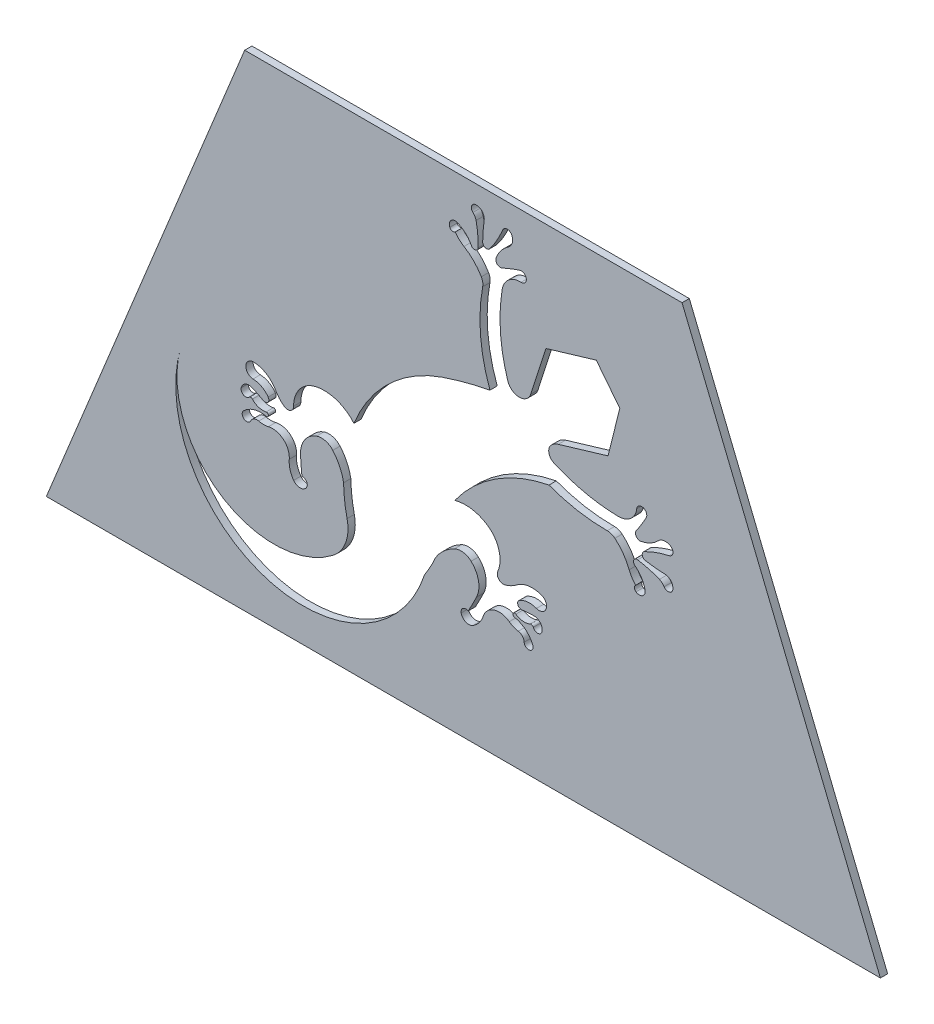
from build123d import *

# Parameters (mm, degrees)
MODEL_R             = 0.098308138
BOSS_EXTRUDE1_DEPTH = 6.35


with BuildPart() as part:
    # Model → Boss-Extrude1 (new body)
    with BuildSketch(Plane.XY):
        Polygon((-403.479102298, 1061.028678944), (325.74646998, 1061.028678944), (152.340544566, 1485.635049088), (-230.073176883, 1485.635049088), align=None)
        with Locations((-5.098355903, 1464.782304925)):
            Circle(MODEL_R, mode=Mode.SUBTRACT)
        with Locations((143.355476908, 1287.363724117)):
            Circle(MODEL_R, mode=Mode.SUBTRACT)
        with BuildLine():
            Line((77.362499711, 1404.630559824), (97.910261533, 1378.488063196))
            Line((97.910261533, 1378.488063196), (87.636380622, 1337.297972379))
            Line((87.636380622, 1337.297972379), (44.190567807, 1324.344062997))
            ThreePointArc((44.190567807, 1324.344062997), (40.867583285, 1322.88749348), (38.000856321, 1320.663601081))
            ThreePointArc((38.000856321, 1320.663601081), (35.882271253, 1313.885747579), (40.272470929, 1308.304184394))
            ThreePointArc((40.272470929, 1308.304184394), (55.324635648, 1302.597238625), (70.929771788, 1298.645451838))
            ThreePointArc((70.929771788, 1298.645451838), (83.595834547, 1296.756890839), (96.377016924, 1295.958651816))
            ThreePointArc((96.377016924, 1295.958651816), (102.880823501, 1297.146398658), (108.40734738, 1300.775141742))
            ThreePointArc((108.40734738, 1300.775141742), (111.325954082, 1304.873260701), (112.703548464, 1309.712173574))
            ThreePointArc((112.703548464, 1309.712173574), (118.37926414, 1313.453786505), (120.969595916, 1307.1685978))
            ThreePointArc((120.969595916, 1307.1685978), (116.868796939, 1300.005219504), (112.352820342, 1293.09605919))
            ThreePointArc((112.352820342, 1293.09605919), (112.265582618, 1288.71088854), (116.281705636, 1286.947911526))
            ThreePointArc((116.281705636, 1286.947911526), (124.572026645, 1289.791567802), (131.593813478, 1295.036595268))
            ThreePointArc((131.593813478, 1295.036595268), (136.778204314, 1297.581892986), (142.408029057, 1296.292892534))
            ThreePointArc((142.408029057, 1296.292892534), (144.344656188, 1291.883510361), (140.99750033, 1288.420892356))
            ThreePointArc((140.99750033, 1288.420892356), (129.906994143, 1285.258831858), (119.334078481, 1280.653247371))
            ThreePointArc((119.334078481, 1280.653247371), (117.555331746, 1277.139328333), (120.328261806, 1274.342468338))
            ThreePointArc((120.328261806, 1274.342468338), (128.847144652, 1273.205583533), (137.42150374, 1272.618865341))
            ThreePointArc((137.42150374, 1272.618865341), (142.766555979, 1269.923214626), (144.199864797, 1264.111008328))
            ThreePointArc((144.199864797, 1264.111008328), (140.903639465, 1260.85202948), (136.678956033, 1262.759408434))
            ThreePointArc((136.678956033, 1262.759408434), (134.896136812, 1264.85599939), (132.544630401, 1266.285878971))
            ThreePointArc((132.544630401, 1266.285878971), (123.188713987, 1269.480437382), (113.528407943, 1271.58207068))
            ThreePointArc((113.528407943, 1271.58207068), (110.120341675, 1269.69144042), (111.130809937, 1265.927353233))
            ThreePointArc((111.130809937, 1265.927353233), (116.867588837, 1259.702984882), (120.029817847, 1251.850997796))
            ThreePointArc((120.029817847, 1251.850997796), (117.833219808, 1246.533122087), (112.079735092, 1246.580647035))
            ThreePointArc((112.079735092, 1246.580647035), (110.739667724, 1248.905274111), (111.707271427, 1251.407955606))
            ThreePointArc((111.707271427, 1251.407955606), (108.475420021, 1255.581553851), (106.109123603, 1260.300073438))
            ThreePointArc((106.109123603, 1260.300073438), (100.966496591, 1269.881599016), (93.616651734, 1277.896087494))
            ThreePointArc((93.616651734, 1277.896087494), (90.509767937, 1279.700231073), (86.969211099, 1280.310246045))
            ThreePointArc((86.969211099, 1280.310246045), (61.065624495, 1282.510139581), (35.999675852, 1289.404597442))
            ThreePointArc((35.999675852, 1289.404597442), (-10.264711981, 1270.931712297), (-46.351018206, 1236.589033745))
            ThreePointArc((-46.351018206, 1236.589033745), (-31.520050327, 1237.475426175), (-17.708329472, 1232.000057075))
            ThreePointArc((-17.708329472, 1232.000057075), (-7.7848607, 1218.391628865), (-8.785182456, 1201.579017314))
            ThreePointArc((-8.785182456, 1201.579017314), (-7.952048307, 1196.144611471), (-2.709677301, 1194.487980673))
            ThreePointArc((-2.709677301, 1194.487980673), (2.717023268, 1196.485851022), (7.623171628, 1199.546941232))
            ThreePointArc((7.623171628, 1199.546941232), (18.291289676, 1204.051813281), (29.785411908, 1202.641930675))
            ThreePointArc((29.785411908, 1202.641930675), (33.419231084, 1194.226990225), (25.041792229, 1190.507530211))
            ThreePointArc((25.041792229, 1190.507530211), (17.425363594, 1191.536380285), (10.135018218, 1189.103402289))
            ThreePointArc((10.135018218, 1189.103402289), (8.745276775, 1185.256873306), (12.188782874, 1183.050194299))
            ThreePointArc((12.188782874, 1183.050194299), (17.514535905, 1183.507899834), (22.853403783, 1183.771773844))
            ThreePointArc((22.853403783, 1183.771773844), (28.361529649, 1181.370125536), (29.992501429, 1175.586761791))
            ThreePointArc((29.992501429, 1175.586761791), (26.415233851, 1172.259254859), (22.272911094, 1174.849681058))
            ThreePointArc((22.272911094, 1174.849681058), (21.172665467, 1175.993764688), (19.585478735, 1175.976269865))
            ThreePointArc((19.585478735, 1175.976269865), (13.148597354, 1174.931336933), (7.034523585, 1177.199249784))
            ThreePointArc((7.034523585, 1177.199249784), (4.5421342, 1176.481774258), (5.777831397, 1174.201461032))
            ThreePointArc((5.777831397, 1174.201461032), (12.259631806, 1171.891390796), (17.671134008, 1167.641001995))
            ThreePointArc((17.671134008, 1167.641001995), (20.008011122, 1164.609849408), (21.788206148, 1161.221666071))
            ThreePointArc((21.788206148, 1161.221666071), (19.039731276, 1155.889572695), (14.269844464, 1159.527362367))
            ThreePointArc((14.269844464, 1159.527362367), (12.71660828, 1163.330639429), (9.110730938, 1165.299168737))
            ThreePointArc((9.110730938, 1165.299168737), (4.976207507, 1166.476833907), (1.23784776, 1168.599531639))
            ThreePointArc((1.23784776, 1168.599531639), (-12.041687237, 1170.773318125), (-21.560506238, 1161.262088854))
            ThreePointArc((-21.560506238, 1161.262088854), (-25.014755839, 1154.738476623), (-30.494519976, 1149.79261554))
            ThreePointArc((-30.494519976, 1149.79261554), (-36.768108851, 1149.281822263), (-40.802057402, 1154.11360105))
            ThreePointArc((-40.802057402, 1154.11360105), (-39.208663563, 1158.42616402), (-34.62377758, 1158.766639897))
            ThreePointArc((-34.62377758, 1158.766639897), (-30.944555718, 1165.724695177), (-27.417212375, 1172.76096235))
            ThreePointArc((-27.417212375, 1172.76096235), (-25.638409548, 1185.981727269), (-32.109324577, 1197.647061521))
            ThreePointArc((-32.109324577, 1197.647061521), (-39.073948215, 1200.961765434), (-46.693644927, 1199.764490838))
            ThreePointArc((-46.693644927, 1199.764490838), (-55.873775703, 1193.58389358), (-63.044730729, 1185.154659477))
            ThreePointArc((-63.044730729, 1185.154659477), (-67.558720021, 1175.919711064), (-72.800932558, 1167.07778937))
            ThreePointArc((-72.800932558, 1167.07778937), (-211.693944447, 1095.354492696), (-285.960247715, 1232.904542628))
            ThreePointArc((-285.960247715, 1232.904542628), (-252.437550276, 1139.29848473), (-153.036483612, 1141.599194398))
            ThreePointArc((-153.036483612, 1141.599194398), (-141.781526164, 1156.812977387), (-140.542271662, 1175.696766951))
            ThreePointArc((-140.542271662, 1175.696766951), (-142.724562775, 1188.449359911), (-143.605116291, 1201.357328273))
            ThreePointArc((-143.605116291, 1201.357328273), (-146.959652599, 1211.903496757), (-153.036483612, 1221.152643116))
            ThreePointArc((-153.036483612, 1221.152643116), (-159.600818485, 1225.202674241), (-167.305393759, 1224.838305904))
            ThreePointArc((-167.305393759, 1224.838305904), (-177.783088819, 1216.581752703), (-181.253883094, 1203.701288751))
            ThreePointArc((-181.253883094, 1203.701288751), (-180.721107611, 1195.848432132), (-180.018025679, 1188.008988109))
            ThreePointArc((-180.018025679, 1188.008988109), (-175.921277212, 1185.922422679), (-176.119061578, 1181.329168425))
            ThreePointArc((-176.119061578, 1181.329168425), (-181.707358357, 1178.432659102), (-187.295655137, 1181.329168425))
            ThreePointArc((-187.295655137, 1181.329168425), (-190.437209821, 1188.008988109), (-191.100772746, 1195.360793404))
            ThreePointArc((-191.100772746, 1195.360793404), (-196.202300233, 1207.81253283), (-209.289669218, 1210.941777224))
            ThreePointArc((-209.289669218, 1210.941777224), (-213.558002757, 1210.429421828), (-217.826336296, 1210.941777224))
            ThreePointArc((-217.826336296, 1210.941777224), (-221.912885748, 1210.520383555), (-224.815733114, 1207.613334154))
            ThreePointArc((-224.815733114, 1207.613334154), (-230.621135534, 1206.102494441), (-231.094455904, 1212.082569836))
            ThreePointArc((-231.094455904, 1212.082569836), (-228.142776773, 1214.519057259), (-224.815733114, 1216.411056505))
            ThreePointArc((-224.815733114, 1216.411056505), (-218.181768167, 1218.238806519), (-211.310874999, 1217.863322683))
            ThreePointArc((-211.310874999, 1217.863322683), (-209.289669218, 1219.488592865), (-211.310874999, 1221.113863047))
            ThreePointArc((-211.310874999, 1221.113863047), (-217.826336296, 1221.386059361), (-223.358724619, 1224.838305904))
            ThreePointArc((-223.358724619, 1224.838305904), (-224.815733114, 1225.468063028), (-226.27274161, 1224.838305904))
            ThreePointArc((-226.27274161, 1224.838305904), (-231.094455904, 1224.050767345), (-233.107118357, 1228.502546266))
            ThreePointArc((-233.107118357, 1228.502546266), (-229.367058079, 1233.205663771), (-223.358724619, 1233.291069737))
            ThreePointArc((-223.358724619, 1233.291069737), (-218.537006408, 1230.983652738), (-213.802320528, 1228.502546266))
            ThreePointArc((-213.802320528, 1228.502546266), (-209.77344574, 1229.206346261), (-209.568017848, 1233.291069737))
            ThreePointArc((-209.568017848, 1233.291069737), (-215.350875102, 1238.353389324), (-222.772838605, 1240.349128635))
            ThreePointArc((-222.772838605, 1240.349128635), (-229.06089331, 1247.018178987), (-222.456326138, 1253.373928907))
            ThreePointArc((-222.456326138, 1253.373928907), (-211.310874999, 1250.230438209), (-203.213905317, 1241.951446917))
            ThreePointArc((-203.213905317, 1241.951446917), (-199.872692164, 1237.23161009), (-195.640351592, 1233.291069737))
            ThreePointArc((-195.640351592, 1233.291069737), (-190.165140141, 1232.792131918), (-187.295790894, 1237.481877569))
            ThreePointArc((-187.295790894, 1237.481877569), (-181.718403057, 1253.373928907), (-167.305393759, 1262.087694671))
            ThreePointArc((-167.305393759, 1262.087694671), (-149.405586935, 1260.907356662), (-134.555730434, 1250.84365734))
            ThreePointArc((-134.555730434, 1250.84365734), (-104.016917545, 1296.025592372), (-57.411235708, 1324.344080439))
            ThreePointArc((-57.411235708, 1324.344080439), (-36.712301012, 1330.640195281), (-15.618780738, 1335.451677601))
            ThreePointArc((-15.618780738, 1335.451677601), (-23.882621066, 1372.556975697), (-21.986329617, 1410.524044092))
            ThreePointArc((-21.986329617, 1410.524044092), (-21.962319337, 1414.116687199), (-23.190206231, 1417.493069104))
            ThreePointArc((-23.190206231, 1417.493069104), (-29.782731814, 1426.141239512), (-38.307024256, 1432.893178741))
            ThreePointArc((-38.307024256, 1432.893178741), (-42.5342195, 1436.054603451), (-46.072374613, 1439.97190408))
            ThreePointArc((-46.072374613, 1439.97190408), (-48.706482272, 1439.460877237), (-50.758313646, 1441.189940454))
            ThreePointArc((-50.758313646, 1441.189940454), (-49.790328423, 1446.861611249), (-44.168397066, 1448.085838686))
            ThreePointArc((-44.168397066, 1448.085838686), (-36.997238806, 1443.588296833), (-31.882267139, 1436.843635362))
            ThreePointArc((-31.882267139, 1436.843635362), (-28.355409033, 1435.185120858), (-25.893323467, 1438.20630161))
            ThreePointArc((-25.893323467, 1438.20630161), (-26.258183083, 1448.085838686), (-27.752520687, 1457.858521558))
            ThreePointArc((-27.752520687, 1457.858521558), (-28.745239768, 1460.425357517), (-30.494519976, 1462.550012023))
            ThreePointArc((-30.494519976, 1462.550012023), (-31.626873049, 1467.044878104), (-27.837616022, 1469.714630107))
            ThreePointArc((-27.837616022, 1469.714630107), (-22.36932479, 1467.278668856), (-20.658661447, 1461.541967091))
            ThreePointArc((-20.658661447, 1461.541967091), (-21.593435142, 1452.998544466), (-21.976882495, 1444.412693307))
            ThreePointArc((-21.976882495, 1444.412693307), (-19.712941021, 1441.189940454), (-15.940384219, 1442.321038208))
            ThreePointArc((-15.940384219, 1442.321038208), (-9.542212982, 1451.915899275), (-4.473646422, 1462.274836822))
            ThreePointArc((-4.473646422, 1462.274836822), (-0.474959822, 1464.958804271), (3.523726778, 1462.274836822))
            ThreePointArc((3.523726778, 1462.274836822), (3.799565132, 1456.505923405), (0.379777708, 1451.851731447))
            ThreePointArc((0.379777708, 1451.851731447), (-6.021485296, 1445.865110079), (-10.282759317, 1438.20630161))
            ThreePointArc((-10.282759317, 1438.20630161), (-9.255759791, 1433.942195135), (-4.923948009, 1433.254635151))
            ThreePointArc((-4.923948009, 1433.254635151), (2.673399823, 1436.481219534), (10.447753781, 1439.2542975))
            ThreePointArc((10.447753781, 1439.2542975), (16.17754381, 1435.59602988), (11.493538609, 1430.669214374))
            ThreePointArc((11.493538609, 1430.669214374), (6.487512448, 1430.166674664), (1.938872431, 1428.016623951))
            ThreePointArc((1.938872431, 1428.016623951), (-2.607718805, 1423.216754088), (-4.923948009, 1417.02439389))
            ThreePointArc((-4.923948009, 1417.02439389), (-6.392491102, 1404.302790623), (-6.767500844, 1391.502197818))
            ThreePointArc((-6.767500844, 1391.502197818), (-4.923948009, 1370.617374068), (0, 1350.237744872))
            ThreePointArc((0, 1350.237744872), (10.020769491, 1342.937465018), (20.041538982, 1350.237744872))
            Line((20.041538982, 1350.237744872), (33.331594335, 1391.502197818))
            Line((33.331594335, 1391.502197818), (77.362499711, 1404.630559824))
        make_face(mode=Mode.SUBTRACT)
    extrude(amount=BOSS_EXTRUDE1_DEPTH)


solid = part.part
